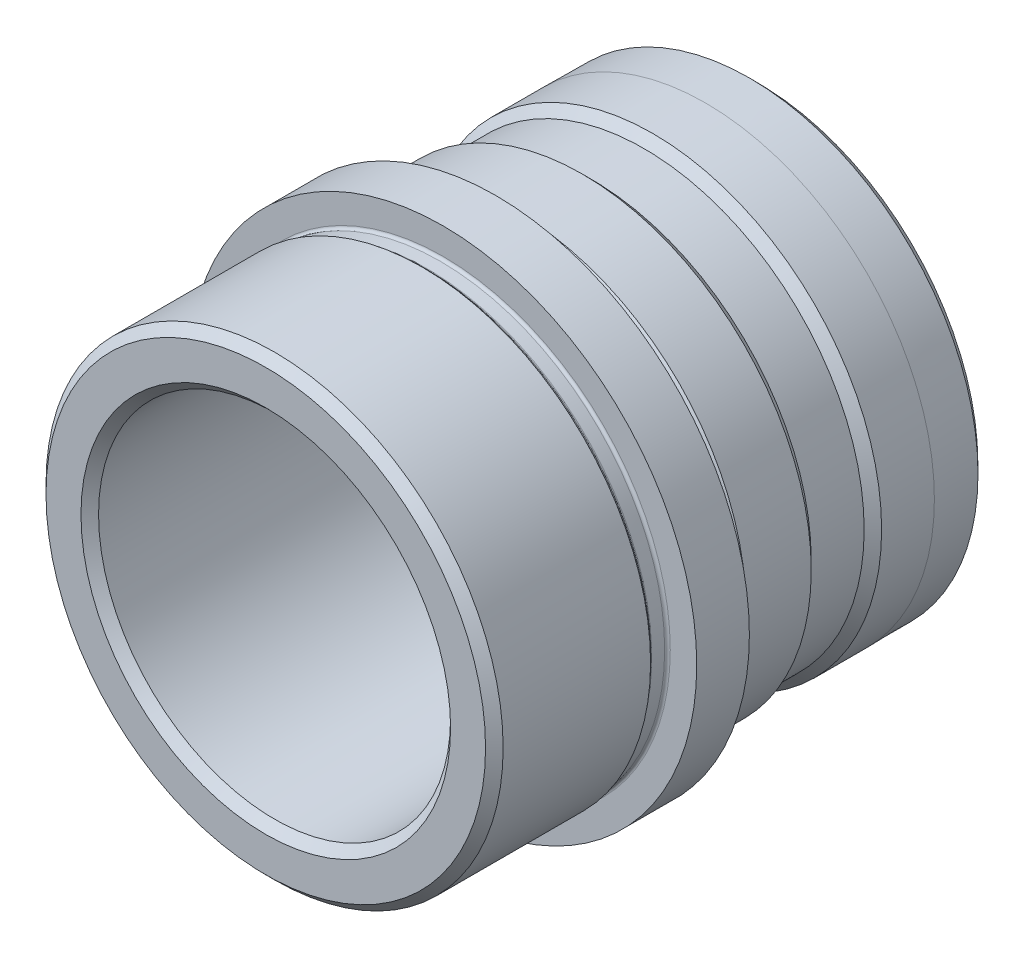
from build123d import *
from OCP.BRepFilletAPI import BRepFilletAPI_MakeChamfer

# Parameters (mm, degrees)
SKETCH2_R          = 2.3749
CUT_EXTRUDE1_DEPTH = 44.090274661
FILLET1_R          = 3.048
CHAMFER1_SIZE      = 0.79375
CHAMFER1_SIZE2     = 0.800768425
FILLET2_R          = 0.254


with BuildPart() as part:
    # Sketch1 → Revolve1 (revolve)
    with BuildSketch(Plane(origin=(0, 0, 0), x_dir=(0, 0, -1), z_dir=(1, 0, 0)), mode=Mode.PRIVATE) as revolve1_sk:
        Polygon((-16.002, 15.88262), (28.448, 15.88262), (28.448, 20.602288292), (23.6855, 20.64385), (18.923, 20.64385), (18.1356, 19.85645), (13.3604, 19.85645), (12.573, 20.64385), (6.67385, 20.64385), (6.2738, 20.2438), (4.7498, 20.2438), (4.7498, 22.8854), (0, 22.8854), (0, 20.2438), (-1.524, 20.2438), (-1.905, 20.6248), (-16.002, 20.6248), align=None)
    revolve(revolve1_sk.sketch.rotate(Axis((0, 0, 0), (0, 0, 1)), 90), axis=Axis((0, 0, 0), (0, 0, 1)))

    # Sketch2 → Cut-Extrude1 (cut, through all)
    with BuildSketch(Plane(origin=(0, 0, 0), x_dir=(1, 0, 0), z_dir=(0, 1, 0))):
        with Locations(Location((0, 15.748, 0), (0, 0, 270))):
            Circle(SKETCH2_R)
    extrude(amount=-CUT_EXTRUDE1_DEPTH, mode=Mode.SUBTRACT)

    # Fillet1
    fillet1_edges = [part.edges().sort_by_distance(p)[0] for p in [
        (15.88262, 0, -28.448),
    ]]
    fillet(fillet1_edges, radius=FILLET1_R)

    # Chamfer1: one chamfer whose edges measure the first distance from different faces: ONE call of the kernel's chamfer builder (chamfer() names one face for all edges)
    chamfer1_edges_1 = [part.edges().sort_by_distance(p)[0] for p in [
        (15.88262, 0, 16.002),
        (20.6248, 0, 16.002),
    ]]
    chamfer1_edges_2 = [part.edges().sort_by_distance(p)[0] for p in [
        (20.602288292, 0, -28.448),
    ]]
    chamfer1_side_2 = [part.faces().sort_by_distance(p)[0] for p in [
        (20.623069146, 0, -26.06675),
    ]]
    chamfer1 = BRepFilletAPI_MakeChamfer(part.part.solid().wrapped)
    for e in chamfer1_edges_1:
        chamfer1.Add(CHAMFER1_SIZE, e.wrapped)
    for e in chamfer1_edges_2:
        chamfer1.Add(CHAMFER1_SIZE, CHAMFER1_SIZE2, e.wrapped, chamfer1_side_2[0].wrapped)  # the first distance lies on this face
    add(Compound.cast(chamfer1.Shape()), mode=Mode.REPLACE)

    # Fillet2
    fillet2_edges = [part.edges().sort_by_distance(p)[0] for p in [
        (20.2438, 0, -6.2738),
        (20.2438, 0, -4.7498),
        (20.2438, 0, 0),
        (20.2438, 0, 1.524),
    ]]
    fillet(fillet2_edges, radius=FILLET2_R)


solid = part.part
